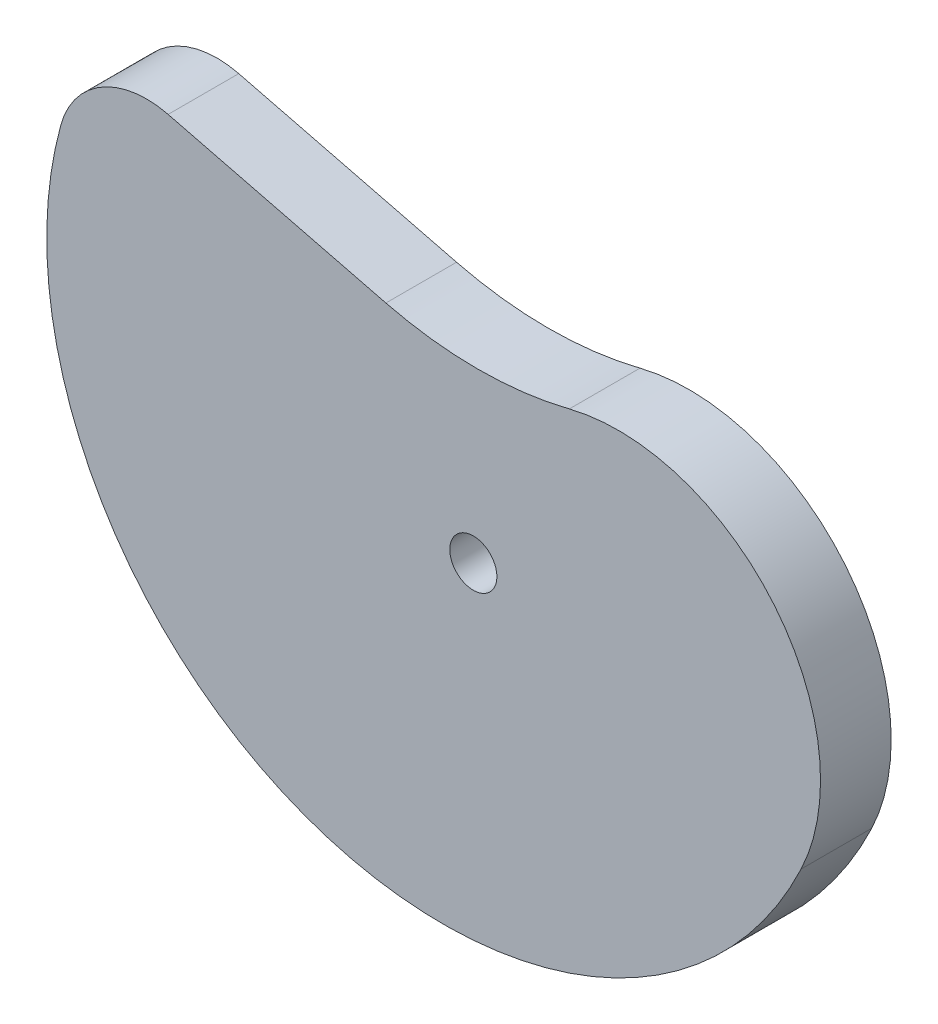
from build123d import *

# Parameters (mm, degrees)
SKETCH1_R      = 31.75
SKETCH1_R_2    = 6.35
EXTRUDE1_DEPTH = 19.05
EXTRUDE2_START = -19.05
SKETCH2_R      = 31.75
EXTRUDE2_DEPTH = 19.05


with BuildPart() as part:
    # Sketch1 → Extrude1 (new body)
    with BuildSketch(Plane.XY):
        with Locations(Location((0, 0, 0), (0, 0, 180))):
            Circle(SKETCH1_R)
        with Locations(Location((0, 0, 0), (0, 0, 180))):
            Circle(SKETCH1_R_2, mode=Mode.SUBTRACT)
    extrude(amount=EXTRUDE1_DEPTH)

    # Sketch2 → Extrude2 (add)
    with BuildSketch(Plane.XY.offset(19.05).offset(EXTRUDE2_START)):
        with BuildLine():
            Line((-82.306103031, 63.627003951), (-23.579917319, 48.945457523))
            ThreePointArc((-23.579917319, 48.945457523), (1.154968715, 45.900453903), (25.889854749, 48.945457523))
            ThreePointArc((25.889854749, 48.945457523), (81.265905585, 30.624898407), (88.383206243, -27.267190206))
            ThreePointArc((88.383206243, -27.267190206), (-45.322363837, -81.733642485), (-111.224570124, 46.721303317))
            ThreePointArc((-111.224570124, 46.721303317), (-100.210299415, 61.067020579), (-82.306103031, 63.627003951))
        make_face()
        Circle(SKETCH2_R, mode=Mode.SUBTRACT)
    extrude(amount=EXTRUDE2_DEPTH)


solid = part.part
